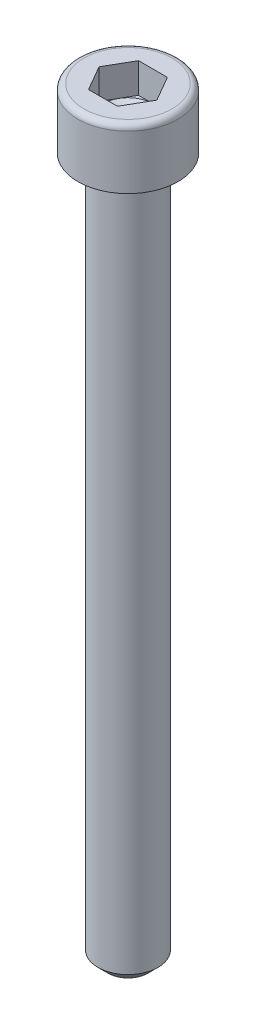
ISO-10303-21;
HEADER;
FILE_DESCRIPTION(('STEP AP214'),'2;1');
FILE_NAME('part.step','',(''),(''),'','','');
FILE_SCHEMA(('AUTOMOTIVE_DESIGN { 1 0 10303 214 1 1 1 1 }'));
ENDSEC;
DATA;
#1=APPLICATION_CONTEXT('core data for automotive mechanical design processes');
#2=APPLICATION_PROTOCOL_DEFINITION('international standard','automotive_design',2000,#1);
#3=PRODUCT_CONTEXT('',#1,'mechanical');
#4=PRODUCT('Part','Part','',(#3));
#5=PRODUCT_RELATED_PRODUCT_CATEGORY('part','',(#4));
#6=PRODUCT_DEFINITION_FORMATION('','',#4);
#7=PRODUCT_DEFINITION_CONTEXT('part definition',#1,'design');
#8=PRODUCT_DEFINITION('design','',#6,#7);
#9=PRODUCT_DEFINITION_SHAPE('','',#8);
#10=(LENGTH_UNIT() NAMED_UNIT(*) SI_UNIT(.MILLI.,.METRE.));
#11=(NAMED_UNIT(*) PLANE_ANGLE_UNIT() SI_UNIT($,.RADIAN.));
#12=(NAMED_UNIT(*) SI_UNIT($,.STERADIAN.) SOLID_ANGLE_UNIT());
#13=UNCERTAINTY_MEASURE_WITH_UNIT(LENGTH_MEASURE(1.E-05),#10,'distance_accuracy_value','');
#14=(GEOMETRIC_REPRESENTATION_CONTEXT(3) GLOBAL_UNCERTAINTY_ASSIGNED_CONTEXT((#13)) GLOBAL_UNIT_ASSIGNED_CONTEXT((#10,
#11,#12)) REPRESENTATION_CONTEXT('',''));
#15=CARTESIAN_POINT('',(0.,0.,0.));
#16=DIRECTION('',(0.,0.,1.));
#17=DIRECTION('',(1.,0.,0.));
#18=AXIS2_PLACEMENT_3D('',#15,#16,#17);
#19=CARTESIAN_POINT('',(2.5,6.,0.));
#20=DIRECTION('',(0.,-1.,0.));
#21=DIRECTION('',(1.,0.,0.));
#22=AXIS2_PLACEMENT_3D('',#19,#20,#21);
#23=PLANE('',#22);
#24=CARTESIAN_POINT('',(0.,6.,0.));
#25=DIRECTION('',(0.,1.,0.));
#26=DIRECTION('',(-1.,0.,0.));
#27=AXIS2_PLACEMENT_3D('',#24,#25,#26);
#28=CIRCLE('',#27,4.4);
#29=CARTESIAN_POINT('',(-4.4,6.,0.));
#30=VERTEX_POINT('',#29);
#31=EDGE_CURVE('E169',#30,#30,#28,.T.);
#32=ORIENTED_EDGE('',*,*,#31,.T.);
#33=EDGE_LOOP('',(#32));
#34=FACE_BOUND('',#33,.T.);
#35=DIRECTION('',(0.499999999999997,0.,0.86602540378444));
#36=VECTOR('',#35,1.);
#37=CARTESIAN_POINT('',(1.44337567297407,6.,-2.5));
#38=LINE('',#37,#36);
#39=CARTESIAN_POINT('',(1.44337567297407,6.,-2.5));
#40=VERTEX_POINT('',#39);
#41=CARTESIAN_POINT('',(2.88675134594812,6.,0.));
#42=VERTEX_POINT('',#41);
#43=EDGE_CURVE('E110',#40,#42,#38,.T.);
#44=ORIENTED_EDGE('',*,*,#43,.T.);
#45=DIRECTION('',(-0.499999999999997,0.,0.86602540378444));
#46=VECTOR('',#45,1.);
#47=CARTESIAN_POINT('',(1.44337567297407,6.,2.5));
#48=LINE('',#47,#46);
#49=CARTESIAN_POINT('',(1.44337567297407,6.,2.5));
#50=VERTEX_POINT('',#49);
#51=EDGE_CURVE('E128',#42,#50,#48,.T.);
#52=ORIENTED_EDGE('',*,*,#51,.T.);
#53=DIRECTION('',(-1.,0.,0.));
#54=VECTOR('',#53,1.);
#55=CARTESIAN_POINT('',(1.44337567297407,6.,2.5));
#56=LINE('',#55,#54);
#57=CARTESIAN_POINT('',(-1.44337567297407,6.,2.5));
#58=VERTEX_POINT('',#57);
#59=EDGE_CURVE('E131',#50,#58,#56,.T.);
#60=ORIENTED_EDGE('',*,*,#59,.T.);
#61=DIRECTION('',(-0.499999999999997,0.,-0.86602540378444));
#62=VECTOR('',#61,1.);
#63=CARTESIAN_POINT('',(-1.44337567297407,6.,2.5));
#64=LINE('',#63,#62);
#65=CARTESIAN_POINT('',(-2.88675134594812,6.,0.));
#66=VERTEX_POINT('',#65);
#67=EDGE_CURVE('E124',#58,#66,#64,.T.);
#68=ORIENTED_EDGE('',*,*,#67,.T.);
#69=DIRECTION('',(0.499999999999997,0.,-0.86602540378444));
#70=VECTOR('',#69,1.);
#71=CARTESIAN_POINT('',(-1.44337567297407,6.,-2.5));
#72=LINE('',#71,#70);
#73=CARTESIAN_POINT('',(-1.44337567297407,6.,-2.5));
#74=VERTEX_POINT('',#73);
#75=EDGE_CURVE('E111',#66,#74,#72,.T.);
#76=ORIENTED_EDGE('',*,*,#75,.T.);
#77=DIRECTION('',(1.,0.,0.));
#78=VECTOR('',#77,1.);
#79=CARTESIAN_POINT('',(1.44337567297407,6.,-2.5));
#80=LINE('',#79,#78);
#81=EDGE_CURVE('E101',#74,#40,#80,.T.);
#82=ORIENTED_EDGE('',*,*,#81,.T.);
#83=EDGE_LOOP('',(#44,#52,#60,#68,#76,#82));
#84=FACE_BOUND('',#83,.T.);
#85=ADVANCED_FACE('F30',(#34,#84),#23,.F.);
#86=CARTESIAN_POINT('',(0.,-70.,0.));
#87=DIRECTION('',(0.,1.,0.));
#88=DIRECTION('',(0.,0.,1.));
#89=AXIS2_PLACEMENT_3D('',#86,#87,#88);
#90=CYLINDRICAL_SURFACE('',#89,3.);
#91=CARTESIAN_POINT('',(0.,-69.,0.));
#92=DIRECTION('',(0.,1.,0.));
#93=DIRECTION('',(0.,0.,1.));
#94=AXIS2_PLACEMENT_3D('',#91,#92,#93);
#95=CIRCLE('',#94,3.);
#96=CARTESIAN_POINT('',(0.,-69.,3.));
#97=VERTEX_POINT('',#96);
#98=EDGE_CURVE('E38',#97,#97,#95,.T.);
#99=ORIENTED_EDGE('',*,*,#98,.T.);
#100=EDGE_LOOP('',(#99));
#101=FACE_BOUND('',#100,.T.);
#102=CARTESIAN_POINT('',(0.,0.,0.));
#103=DIRECTION('',(0.,1.,0.));
#104=DIRECTION('',(0.,0.,1.));
#105=AXIS2_PLACEMENT_3D('',#102,#103,#104);
#106=CIRCLE('',#105,3.);
#107=CARTESIAN_POINT('',(0.,0.,3.));
#108=VERTEX_POINT('',#107);
#109=EDGE_CURVE('E179',#108,#108,#106,.T.);
#110=ORIENTED_EDGE('',*,*,#109,.F.);
#111=EDGE_LOOP('',(#110));
#112=FACE_BOUND('',#111,.T.);
#113=ADVANCED_FACE('F32',(#101,#112),#90,.T.);
#114=CARTESIAN_POINT('',(0.,-70.,0.));
#115=DIRECTION('',(0.,1.,0.));
#116=DIRECTION('',(0.,0.,1.));
#117=AXIS2_PLACEMENT_3D('',#114,#115,#116);
#118=PLANE('',#117);
#119=CARTESIAN_POINT('',(0.,-70.,0.));
#120=DIRECTION('',(0.,1.,0.));
#121=DIRECTION('',(0.,0.,1.));
#122=AXIS2_PLACEMENT_3D('',#119,#120,#121);
#123=CIRCLE('',#122,2.);
#124=CARTESIAN_POINT('',(0.,-70.,2.));
#125=VERTEX_POINT('',#124);
#126=EDGE_CURVE('E11',#125,#125,#123,.F.);
#127=ORIENTED_EDGE('',*,*,#126,.T.);
#128=EDGE_LOOP('',(#127));
#129=FACE_BOUND('',#128,.T.);
#130=ADVANCED_FACE('F189',(#129),#118,.F.);
#131=CARTESIAN_POINT('',(0.,-69.,0.));
#132=DIRECTION('',(0.,1.,0.));
#133=DIRECTION('',(0.,0.,1.));
#134=AXIS2_PLACEMENT_3D('',#131,#132,#133);
#135=CONICAL_SURFACE('',#134,3.,0.785398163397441);
#136=ORIENTED_EDGE('',*,*,#126,.F.);
#137=EDGE_LOOP('',(#136));
#138=FACE_BOUND('',#137,.T.);
#139=ORIENTED_EDGE('',*,*,#98,.F.);
#140=EDGE_LOOP('',(#139));
#141=FACE_BOUND('',#140,.T.);
#142=ADVANCED_FACE('F186',(#138,#141),#135,.T.);
#143=CARTESIAN_POINT('',(0.,0.,0.));
#144=DIRECTION('',(0.,1.,0.));
#145=DIRECTION('',(-1.,0.,0.));
#146=AXIS2_PLACEMENT_3D('',#143,#144,#145);
#147=PLANE('',#146);
#148=ORIENTED_EDGE('',*,*,#109,.T.);
#149=EDGE_LOOP('',(#148));
#150=FACE_BOUND('',#149,.T.);
#151=CARTESIAN_POINT('',(0.,0.,0.));
#152=DIRECTION('',(0.,1.,0.));
#153=DIRECTION('',(-1.,0.,0.));
#154=AXIS2_PLACEMENT_3D('',#151,#152,#153);
#155=CIRCLE('',#154,5.);
#156=CARTESIAN_POINT('',(-5.,0.,0.));
#157=VERTEX_POINT('',#156);
#158=EDGE_CURVE('E176',#157,#157,#155,.T.);
#159=ORIENTED_EDGE('',*,*,#158,.F.);
#160=EDGE_LOOP('',(#159));
#161=FACE_BOUND('',#160,.T.);
#162=ADVANCED_FACE('F188',(#150,#161),#147,.F.);
#163=CARTESIAN_POINT('',(0.,6.,0.));
#164=DIRECTION('',(0.,1.,0.));
#165=DIRECTION('',(-1.,0.,0.));
#166=AXIS2_PLACEMENT_3D('',#163,#164,#165);
#167=CYLINDRICAL_SURFACE('',#166,5.);
#168=CARTESIAN_POINT('',(0.,5.4,0.));
#169=DIRECTION('',(0.,1.,0.));
#170=DIRECTION('',(-1.,0.,0.));
#171=AXIS2_PLACEMENT_3D('',#168,#169,#170);
#172=CIRCLE('',#171,5.);
#173=CARTESIAN_POINT('',(-5.,5.4,0.));
#174=VERTEX_POINT('',#173);
#175=EDGE_CURVE('E173',#174,#174,#172,.T.);
#176=ORIENTED_EDGE('',*,*,#175,.F.);
#177=EDGE_LOOP('',(#176));
#178=FACE_BOUND('',#177,.T.);
#179=ORIENTED_EDGE('',*,*,#158,.T.);
#180=EDGE_LOOP('',(#179));
#181=FACE_BOUND('',#180,.T.);
#182=ADVANCED_FACE('F196',(#178,#181),#167,.T.);
#183=CARTESIAN_POINT('',(0.,5.4,0.));
#184=DIRECTION('',(0.,1.,0.));
#185=DIRECTION('',(-1.,0.,0.));
#186=AXIS2_PLACEMENT_3D('',#183,#184,#185);
#187=TOROIDAL_SURFACE('',#186,4.4,0.6);
#188=ORIENTED_EDGE('',*,*,#31,.F.);
#189=EDGE_LOOP('',(#188));
#190=FACE_BOUND('',#189,.T.);
#191=ORIENTED_EDGE('',*,*,#175,.T.);
#192=EDGE_LOOP('',(#191));
#193=FACE_BOUND('',#192,.T.);
#194=ADVANCED_FACE('F211',(#190,#193),#187,.T.);
#195=CARTESIAN_POINT('',(-1.44337567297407,3.,-2.5));
#196=DIRECTION('',(0.86602540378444,0.,0.499999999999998));
#197=DIRECTION('',(0.499999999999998,0.,-0.86602540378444));
#198=AXIS2_PLACEMENT_3D('',#195,#196,#197);
#199=PLANE('',#198);
#200=ORIENTED_EDGE('',*,*,#75,.F.);
#201=DIRECTION('',(0.,1.,0.));
#202=VECTOR('',#201,1.);
#203=CARTESIAN_POINT('',(-2.88675134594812,3.,0.));
#204=LINE('',#203,#202);
#205=CARTESIAN_POINT('',(-2.88675134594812,3.,0.));
#206=VERTEX_POINT('',#205);
#207=EDGE_CURVE('E154',#206,#66,#204,.T.);
#208=ORIENTED_EDGE('',*,*,#207,.F.);
#209=DIRECTION('',(0.499999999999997,0.,-0.86602540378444));
#210=VECTOR('',#209,1.);
#211=CARTESIAN_POINT('',(-1.44337567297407,3.,-2.5));
#212=LINE('',#211,#210);
#213=CARTESIAN_POINT('',(-2.1650635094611,3.,-1.24999999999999));
#214=VERTEX_POINT('',#213);
#215=EDGE_CURVE('E134',#206,#214,#212,.T.);
#216=ORIENTED_EDGE('',*,*,#215,.T.);
#217=CARTESIAN_POINT('',(-1.44337567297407,3.,-2.5));
#218=VERTEX_POINT('',#217);
#219=EDGE_CURVE('E119',#214,#218,#212,.T.);
#220=ORIENTED_EDGE('',*,*,#219,.T.);
#221=DIRECTION('',(0.,1.,0.));
#222=VECTOR('',#221,1.);
#223=CARTESIAN_POINT('',(-1.44337567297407,3.,-2.5));
#224=LINE('',#223,#222);
#225=EDGE_CURVE('E104',#218,#74,#224,.T.);
#226=ORIENTED_EDGE('',*,*,#225,.T.);
#227=EDGE_LOOP('',(#200,#208,#216,#220,#226));
#228=FACE_BOUND('',#227,.T.);
#229=ADVANCED_FACE('F114',(#228),#199,.T.);
#230=CARTESIAN_POINT('',(1.44337567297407,3.,-2.5));
#231=DIRECTION('',(0.,0.,1.));
#232=DIRECTION('',(1.,0.,0.));
#233=AXIS2_PLACEMENT_3D('',#230,#231,#232);
#234=PLANE('',#233);
#235=ORIENTED_EDGE('',*,*,#81,.F.);
#236=ORIENTED_EDGE('',*,*,#225,.F.);
#237=DIRECTION('',(1.,0.,0.));
#238=VECTOR('',#237,1.);
#239=CARTESIAN_POINT('',(1.44337567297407,3.,-2.5));
#240=LINE('',#239,#238);
#241=CARTESIAN_POINT('',(0.,3.,-2.5));
#242=VERTEX_POINT('',#241);
#243=EDGE_CURVE('E45',#218,#242,#240,.T.);
#244=ORIENTED_EDGE('',*,*,#243,.T.);
#245=CARTESIAN_POINT('',(1.44337567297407,3.,-2.5));
#246=VERTEX_POINT('',#245);
#247=EDGE_CURVE('E136',#242,#246,#240,.T.);
#248=ORIENTED_EDGE('',*,*,#247,.T.);
#249=DIRECTION('',(0.,1.,0.));
#250=VECTOR('',#249,1.);
#251=CARTESIAN_POINT('',(1.44337567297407,3.,-2.5));
#252=LINE('',#251,#250);
#253=EDGE_CURVE('E106',#246,#40,#252,.T.);
#254=ORIENTED_EDGE('',*,*,#253,.T.);
#255=EDGE_LOOP('',(#235,#236,#244,#248,#254));
#256=FACE_BOUND('',#255,.T.);
#257=ADVANCED_FACE('F103',(#256),#234,.T.);
#258=CARTESIAN_POINT('',(1.44337567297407,3.,-2.5));
#259=DIRECTION('',(-0.86602540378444,0.,0.499999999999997));
#260=DIRECTION('',(0.499999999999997,0.,0.86602540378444));
#261=AXIS2_PLACEMENT_3D('',#258,#259,#260);
#262=PLANE('',#261);
#263=ORIENTED_EDGE('',*,*,#43,.F.);
#264=ORIENTED_EDGE('',*,*,#253,.F.);
#265=DIRECTION('',(0.499999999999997,0.,0.86602540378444));
#266=VECTOR('',#265,1.);
#267=CARTESIAN_POINT('',(1.44337567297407,3.,-2.5));
#268=LINE('',#267,#266);
#269=CARTESIAN_POINT('',(2.1650635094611,3.,-1.24999999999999));
#270=VERTEX_POINT('',#269);
#271=EDGE_CURVE('E139',#246,#270,#268,.T.);
#272=ORIENTED_EDGE('',*,*,#271,.T.);
#273=CARTESIAN_POINT('',(2.88675134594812,3.,0.));
#274=VERTEX_POINT('',#273);
#275=EDGE_CURVE('E138',#270,#274,#268,.T.);
#276=ORIENTED_EDGE('',*,*,#275,.T.);
#277=DIRECTION('',(0.,1.,0.));
#278=VECTOR('',#277,1.);
#279=CARTESIAN_POINT('',(2.88675134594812,3.,0.));
#280=LINE('',#279,#278);
#281=EDGE_CURVE('E162',#274,#42,#280,.T.);
#282=ORIENTED_EDGE('',*,*,#281,.T.);
#283=EDGE_LOOP('',(#263,#264,#272,#276,#282));
#284=FACE_BOUND('',#283,.T.);
#285=ADVANCED_FACE('F241',(#284),#262,.T.);
#286=CARTESIAN_POINT('',(1.44337567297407,3.,2.5));
#287=DIRECTION('',(-0.86602540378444,0.,-0.499999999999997));
#288=DIRECTION('',(-0.499999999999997,0.,0.86602540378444));
#289=AXIS2_PLACEMENT_3D('',#286,#287,#288);
#290=PLANE('',#289);
#291=ORIENTED_EDGE('',*,*,#51,.F.);
#292=ORIENTED_EDGE('',*,*,#281,.F.);
#293=DIRECTION('',(-0.499999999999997,0.,0.86602540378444));
#294=VECTOR('',#293,1.);
#295=CARTESIAN_POINT('',(1.44337567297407,3.,2.5));
#296=LINE('',#295,#294);
#297=CARTESIAN_POINT('',(2.1650635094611,3.,1.24999999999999));
#298=VERTEX_POINT('',#297);
#299=EDGE_CURVE('E143',#274,#298,#296,.T.);
#300=ORIENTED_EDGE('',*,*,#299,.T.);
#301=CARTESIAN_POINT('',(1.44337567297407,3.,2.5));
#302=VERTEX_POINT('',#301);
#303=EDGE_CURVE('E142',#298,#302,#296,.T.);
#304=ORIENTED_EDGE('',*,*,#303,.T.);
#305=DIRECTION('',(0.,1.,0.));
#306=VECTOR('',#305,1.);
#307=CARTESIAN_POINT('',(1.44337567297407,3.,2.5));
#308=LINE('',#307,#306);
#309=EDGE_CURVE('E159',#302,#50,#308,.T.);
#310=ORIENTED_EDGE('',*,*,#309,.T.);
#311=EDGE_LOOP('',(#291,#292,#300,#304,#310));
#312=FACE_BOUND('',#311,.T.);
#313=ADVANCED_FACE('F248',(#312),#290,.T.);
#314=CARTESIAN_POINT('',(1.44337567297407,3.,2.5));
#315=DIRECTION('',(0.,0.,-1.));
#316=DIRECTION('',(-1.,0.,0.));
#317=AXIS2_PLACEMENT_3D('',#314,#315,#316);
#318=PLANE('',#317);
#319=ORIENTED_EDGE('',*,*,#59,.F.);
#320=ORIENTED_EDGE('',*,*,#309,.F.);
#321=DIRECTION('',(-1.,0.,0.));
#322=VECTOR('',#321,1.);
#323=CARTESIAN_POINT('',(1.44337567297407,3.,2.5));
#324=LINE('',#323,#322);
#325=CARTESIAN_POINT('',(0.,3.,2.5));
#326=VERTEX_POINT('',#325);
#327=EDGE_CURVE('E147',#302,#326,#324,.T.);
#328=ORIENTED_EDGE('',*,*,#327,.T.);
#329=CARTESIAN_POINT('',(-1.44337567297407,3.,2.5));
#330=VERTEX_POINT('',#329);
#331=EDGE_CURVE('E146',#326,#330,#324,.T.);
#332=ORIENTED_EDGE('',*,*,#331,.T.);
#333=DIRECTION('',(0.,1.,0.));
#334=VECTOR('',#333,1.);
#335=CARTESIAN_POINT('',(-1.44337567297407,3.,2.5));
#336=LINE('',#335,#334);
#337=EDGE_CURVE('E156',#330,#58,#336,.T.);
#338=ORIENTED_EDGE('',*,*,#337,.T.);
#339=EDGE_LOOP('',(#319,#320,#328,#332,#338));
#340=FACE_BOUND('',#339,.T.);
#341=ADVANCED_FACE('F256',(#340),#318,.T.);
#342=CARTESIAN_POINT('',(-1.44337567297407,3.,2.5));
#343=DIRECTION('',(0.86602540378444,0.,-0.499999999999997));
#344=DIRECTION('',(-0.499999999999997,0.,-0.86602540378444));
#345=AXIS2_PLACEMENT_3D('',#342,#343,#344);
#346=PLANE('',#345);
#347=ORIENTED_EDGE('',*,*,#67,.F.);
#348=ORIENTED_EDGE('',*,*,#337,.F.);
#349=DIRECTION('',(-0.499999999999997,0.,-0.86602540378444));
#350=VECTOR('',#349,1.);
#351=CARTESIAN_POINT('',(-1.44337567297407,3.,2.5));
#352=LINE('',#351,#350);
#353=CARTESIAN_POINT('',(-2.1650635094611,3.,1.24999999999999));
#354=VERTEX_POINT('',#353);
#355=EDGE_CURVE('E151',#330,#354,#352,.T.);
#356=ORIENTED_EDGE('',*,*,#355,.T.);
#357=EDGE_CURVE('E150',#354,#206,#352,.T.);
#358=ORIENTED_EDGE('',*,*,#357,.T.);
#359=ORIENTED_EDGE('',*,*,#207,.T.);
#360=EDGE_LOOP('',(#347,#348,#356,#358,#359));
#361=FACE_BOUND('',#360,.T.);
#362=ADVANCED_FACE('F264',(#361),#346,.T.);
#363=CARTESIAN_POINT('',(-4.33012701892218,3.,2.5));
#364=DIRECTION('',(0.,-1.,0.));
#365=DIRECTION('',(0.,0.,-1.));
#366=AXIS2_PLACEMENT_3D('',#363,#364,#365);
#367=PLANE('',#366);
#368=ORIENTED_EDGE('',*,*,#243,.F.);
#369=ORIENTED_EDGE('',*,*,#219,.F.);
#370=CARTESIAN_POINT('',(0.,3.,0.));
#371=DIRECTION('',(0.,1.,0.));
#372=DIRECTION('',(-1.,0.,0.));
#373=AXIS2_PLACEMENT_3D('',#370,#371,#372);
#374=CIRCLE('',#373,2.5);
#375=EDGE_CURVE('E397',#242,#214,#374,.T.);
#376=ORIENTED_EDGE('',*,*,#375,.F.);
#377=EDGE_LOOP('',(#368,#369,#376));
#378=FACE_BOUND('',#377,.T.);
#379=ADVANCED_FACE('F272',(#378),#367,.F.);
#380=ORIENTED_EDGE('',*,*,#215,.F.);
#381=ORIENTED_EDGE('',*,*,#357,.F.);
#382=EDGE_CURVE('E120',#214,#354,#374,.T.);
#383=ORIENTED_EDGE('',*,*,#382,.F.);
#384=EDGE_LOOP('',(#380,#381,#383));
#385=FACE_BOUND('',#384,.T.);
#386=ADVANCED_FACE('F280',(#385),#367,.F.);
#387=ORIENTED_EDGE('',*,*,#355,.F.);
#388=ORIENTED_EDGE('',*,*,#331,.F.);
#389=EDGE_CURVE('E166',#354,#326,#374,.T.);
#390=ORIENTED_EDGE('',*,*,#389,.F.);
#391=EDGE_LOOP('',(#387,#388,#390));
#392=FACE_BOUND('',#391,.T.);
#393=ADVANCED_FACE('F289',(#392),#367,.F.);
#394=ORIENTED_EDGE('',*,*,#327,.F.);
#395=ORIENTED_EDGE('',*,*,#303,.F.);
#396=EDGE_CURVE('E170',#326,#298,#374,.T.);
#397=ORIENTED_EDGE('',*,*,#396,.F.);
#398=EDGE_LOOP('',(#394,#395,#397));
#399=FACE_BOUND('',#398,.T.);
#400=ADVANCED_FACE('F296',(#399),#367,.F.);
#401=ORIENTED_EDGE('',*,*,#299,.F.);
#402=ORIENTED_EDGE('',*,*,#275,.F.);
#403=EDGE_CURVE('E392',#298,#270,#374,.T.);
#404=ORIENTED_EDGE('',*,*,#403,.F.);
#405=EDGE_LOOP('',(#401,#402,#404));
#406=FACE_BOUND('',#405,.T.);
#407=ADVANCED_FACE('F303',(#406),#367,.F.);
#408=ORIENTED_EDGE('',*,*,#271,.F.);
#409=ORIENTED_EDGE('',*,*,#247,.F.);
#410=EDGE_CURVE('E395',#270,#242,#374,.T.);
#411=ORIENTED_EDGE('',*,*,#410,.F.);
#412=EDGE_LOOP('',(#408,#409,#411));
#413=FACE_BOUND('',#412,.T.);
#414=ADVANCED_FACE('F283',(#413),#367,.F.);
#415=CARTESIAN_POINT('',(0.,3.,0.));
#416=DIRECTION('',(0.,1.,0.));
#417=DIRECTION('',(-1.,0.,0.));
#418=AXIS2_PLACEMENT_3D('',#415,#416,#417);
#419=CONICAL_SURFACE('',#418,2.5,1.04719755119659);
#420=CARTESIAN_POINT('',(0.,1.55662432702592,0.));
#421=VERTEX_POINT('',#420);
#422=VERTEX_LOOP('',#421);
#423=FACE_BOUND('',#422,.T.);
#424=ORIENTED_EDGE('',*,*,#389,.T.);
#425=ORIENTED_EDGE('',*,*,#396,.T.);
#426=ORIENTED_EDGE('',*,*,#403,.T.);
#427=ORIENTED_EDGE('',*,*,#410,.T.);
#428=ORIENTED_EDGE('',*,*,#375,.T.);
#429=ORIENTED_EDGE('',*,*,#382,.T.);
#430=EDGE_LOOP('',(#424,#425,#426,#427,#428,#429));
#431=FACE_BOUND('',#430,.T.);
#432=ADVANCED_FACE('F209',(#423,#431),#419,.F.);
#433=CLOSED_SHELL('',(#85,#113,#130,#142,#162,#182,#194,#229,#257,#285,#313,#341,#362,#379,#386,
#393,#400,#407,#414,#432));
#434=MANIFOLD_SOLID_BREP('B2',#433);
#435=ADVANCED_BREP_SHAPE_REPRESENTATION('',(#18,#434),#14);
#436=SHAPE_DEFINITION_REPRESENTATION(#9,#435);
ENDSEC;
END-ISO-10303-21;
